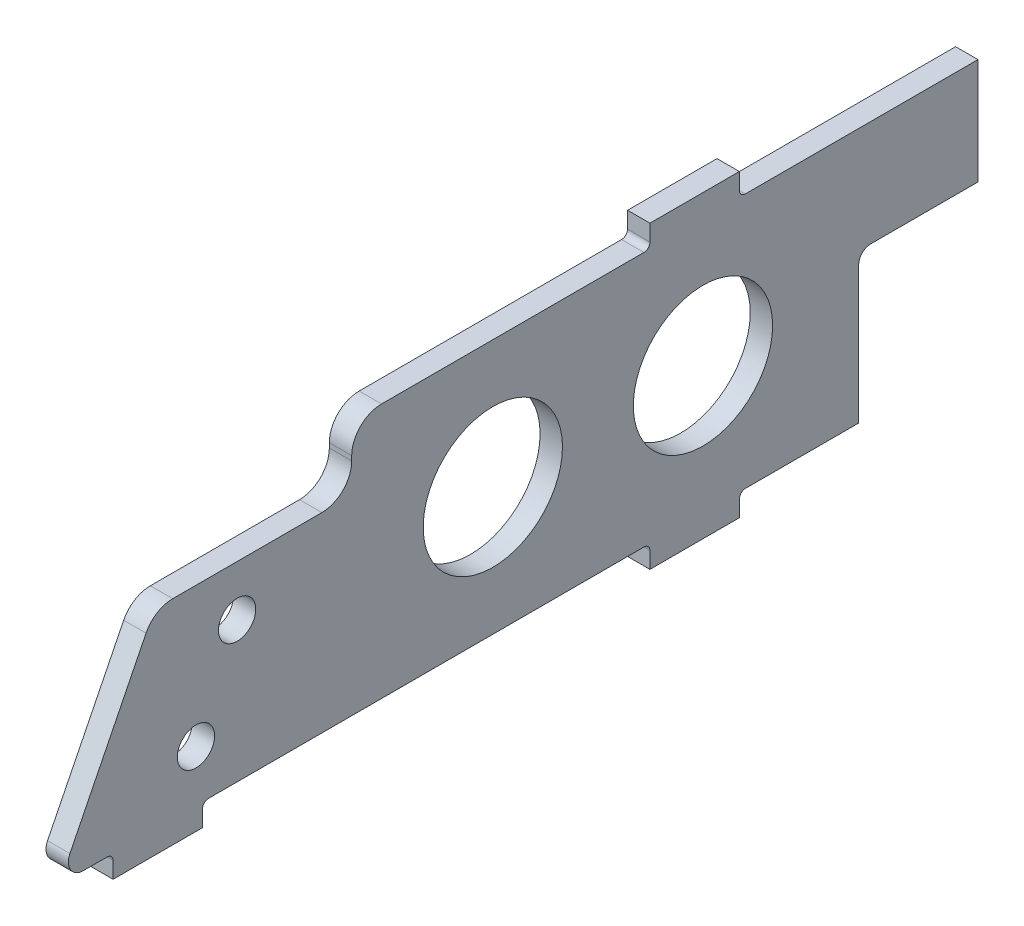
from build123d import *

# Parameters (mm, degrees)
SKETCH1_W                      = 4.7625
SKETCH1_H                      = 79.248
EXTRUDE1_DEPTH                 = 266.026600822
CUT_EXTRUDE1_DEPTH             = 374.935232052
SKETCH3_W                      = 19.05
SKETCH3_H                      = 4.7625
EXTRUDE2_DEPTH                 = 4.7625
F_5_16_0_3125_DIAMETER_HOLE1_D = 7.9375
SKETCH6_R                      = 14.827646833
CUT_EXTRUDE2_DEPTH             = 311.44453665
FILLET3_R                      = 1.27


with BuildPart() as part:
    # Sketch1 → Extrude1 (new body)
    with BuildSketch(Plane.XY):
        with Locations((-8.98525, 223.120598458)):
            Rectangle(SKETCH1_W, SKETCH1_H)
    extrude(amount=EXTRUDE1_DEPTH)

    # Sketch2 → Cut-Extrude1 (cut, through all)
    with BuildSketch(Plane(origin=(-6.604, 0, 0), x_dir=(0, 0, -1), z_dir=(1, 0, 0))):
        with BuildLine():
            Line((0, 215.246598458), (-22.86, 215.246598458))
            ThreePointArc((-22.86, 215.246598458), (-24.656051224, 214.502649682), (-25.4, 212.706598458))
            Line((-25.4, 212.706598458), (-25.4, 183.496598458))
            Line((-25.4, 183.496598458), (0, 183.496598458))
            Line((0, 183.496598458), (0, 215.246598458))
        make_face()
        with BuildLine():
            Line((-127, 237.813515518), (6.35, 237.813515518))
            Line((6.35, 237.813515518), (6.35, 259.715))
            Line((6.35, 259.715), (6.35, 274.054337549))
            Line((6.35, 274.054337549), (-12.487103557, 274.054337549))
            Line((-12.487103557, 274.054337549), (-284.446462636, 274.054337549))
            Line((-284.446462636, 274.054337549), (-284.446462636, 183.496598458))
            Line((-284.446462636, 183.496598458), (-190.5, 183.496598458))
            ThreePointArc((-190.5, 183.496598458), (-193.199639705, 185.000499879), (-193.341804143, 188.087498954))
            Line((-193.341804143, 188.087498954), (-177.133608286, 220.61839945))
            ThreePointArc((-177.133608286, 220.61839945), (-174.792197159, 223.185877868), (-171.45, 224.136598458))
            Line((-171.45, 224.136598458), (-139.7, 224.136598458))
            ThreePointArc((-139.7, 224.136598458), (-135.209871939, 225.996470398), (-133.35, 230.486598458))
            Line((-133.35, 230.486598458), (-133.35, 231.463515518))
            ThreePointArc((-133.35, 231.463515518), (-131.490128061, 235.953643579), (-127, 237.813515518))
        make_face()
    extrude(amount=-CUT_EXTRUDE1_DEPTH, mode=Mode.SUBTRACT)

    # Sketch3 → Extrude2 (add)
    with BuildSketch(Plane(origin=(-6.604, 0, 0), x_dir=(0, 0, -1), z_dir=(1, 0, 0))):
        with Locations((-60.325, 181.115348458)):
            Rectangle(SKETCH3_W, SKETCH3_H)
        with Locations((-174.625, 181.115348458)):
            Rectangle(SKETCH3_W, SKETCH3_H)
        with Locations((-60.325, 240.194765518)):
            Rectangle(SKETCH3_W, SKETCH3_H)
    extrude(amount=-EXTRUDE2_DEPTH)

    # 5_16 _0.3125_ Diameter Hole1 (through all)
    with Locations(Plane(origin=(-6.604, 0, 0), x_dir=(0, 0, -1), z_dir=(1, 0, 0))):
        with Locations((-157.747086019, 213.392398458), (-166.510086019, 194.418598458)):
            Hole(F_5_16_0_3125_DIAMETER_HOLE1_D / 2)

    # Sketch6 → Cut-Extrude2 (cut, through all)
    with BuildSketch(Plane(origin=(-6.604, 0, 0), x_dir=(0, 0, -1), z_dir=(1, 0, 0))):
        with Locations((-103.299900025, 210.655056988)):
            Circle(SKETCH6_R)
        with Locations((-58.558893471, 210.655056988)):
            Circle(SKETCH6_R)
    extrude(amount=-CUT_EXTRUDE2_DEPTH, mode=Mode.SUBTRACT)

    # Fillet3
    fillet3_edges = [part.edges().sort_by_distance(p)[0] for p in [
        (-8.98525, 237.813515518, 69.85),
        (-8.98525, 237.813515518, 50.8),
        (-8.98525, 183.496598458, 69.85),
        (-8.98525, 183.496598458, 50.8),
        (-8.98525, 183.496598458, 165.1),
        (-8.98525, 183.496598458, 184.15),
    ]]
    fillet(fillet3_edges, radius=FILLET3_R)


solid = part.part
